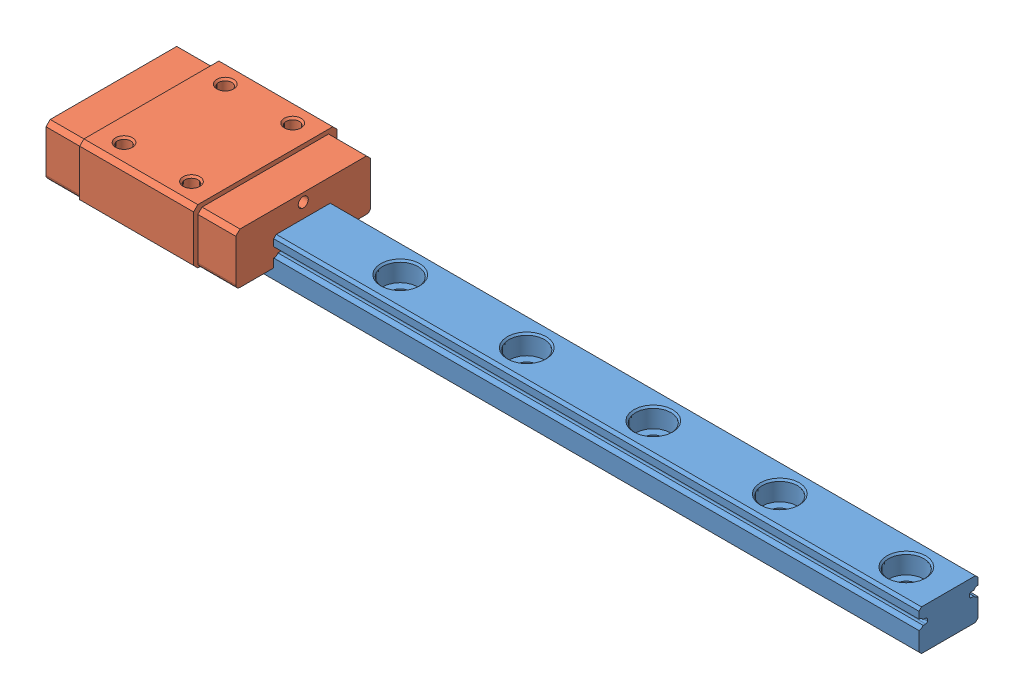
SolidWorks assembly MLN7C.stp.sldasm, configuration 默认 (file format 13000). Lengths in mm.
Overall size (100 8 17).
2 component instances, 2 part files, 0 mates.
Components (placement in the parent):
- MLNR7R100 E=5-1: MLNR7R100 E=5.SLDPRT [默认] at origin size (100 4.8 7)
- MLN7C-1: MLN7C.SLDPRT [默认] at (1 1.5 0) size (22.5 6.5 17)
